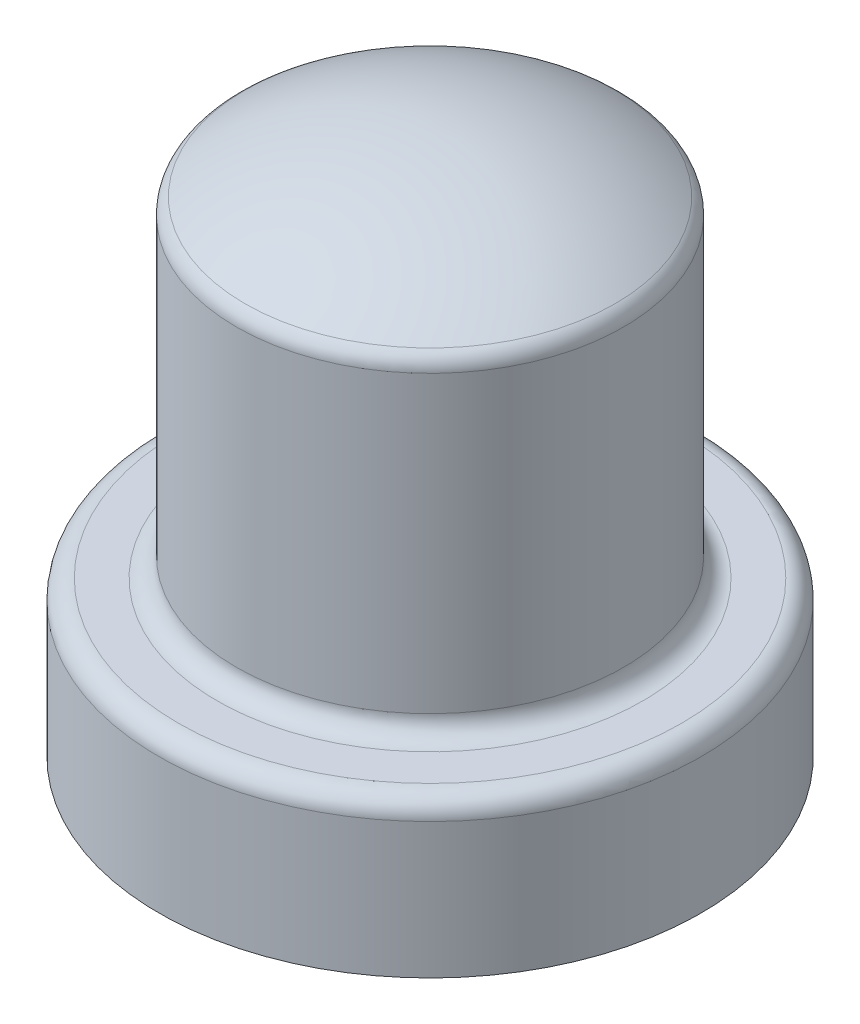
from build123d import *


with BuildPart() as part:
    # Esquisse1 → R_volution1 (revolve)
    with BuildSketch(Plane.XY, mode=Mode.PRIVATE) as r_volution1_sk:
        with BuildLine():
            Line((-6, 0), (-7, 0))
            Line((-7, 0), (-7, 3.5))
            ThreePointArc((-7, 3.5), (-6.853553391, 3.853553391), (-6.5, 4))
            Line((-6.5, 4), (-5.5, 4))
            ThreePointArc((-5.5, 4), (-5.146446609, 4.146446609), (-5, 4.5))
            Line((-5, 4.5), (-5, 12.114378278))
            ThreePointArc((-5, 12.114378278), (-4.941941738, 12.348231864), (-4.78125, 12.52777692))
            ThreePointArc((-4.78125, 12.52777692), (-2.501389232, 13.623610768), (0, 14))
            Line((0, 14), (0, 13))
            ThreePointArc((0, 13), (-2.081806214, 12.705281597), (-4, 11.84428877))
            Line((-4, 11.84428877), (-4, 3))
            Line((-4, 3), (-6, 3))
            Line((-6, 3), (-6, 0))
        make_face()
    revolve(r_volution1_sk.sketch.rotate(Axis((0, -12.230788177, 0), (0, 1, 0)), 270), axis=Axis((0, -12.230788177, 0), (0, 1, 0)))


solid = part.part
